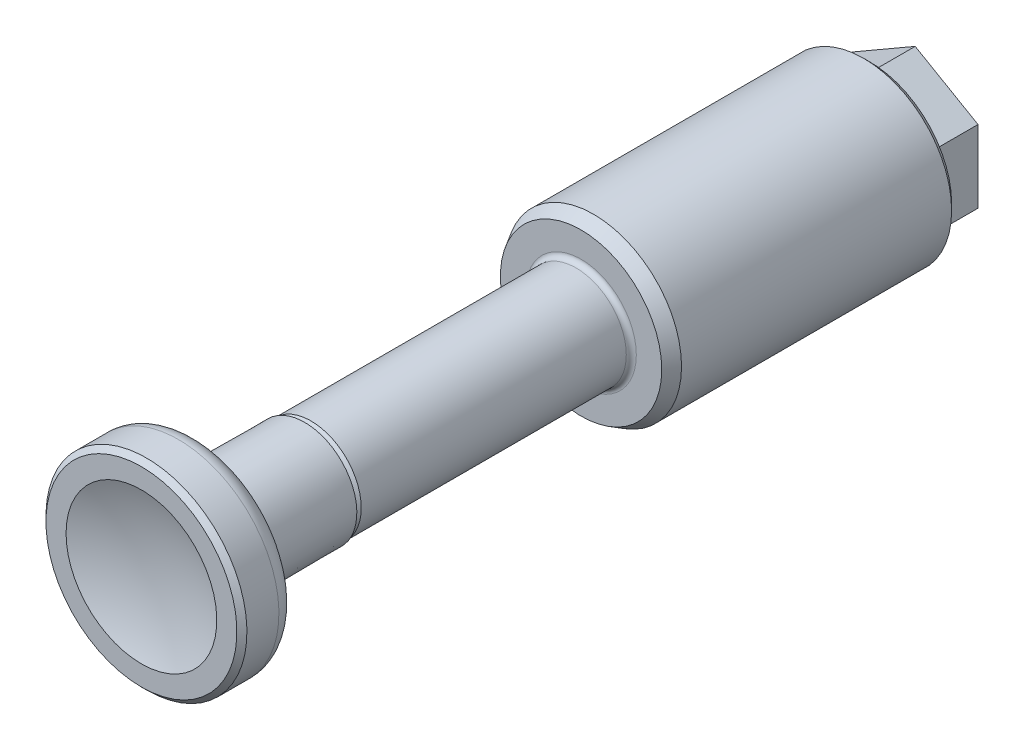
ISO-10303-21;
HEADER;
FILE_DESCRIPTION(('STEP AP214'),'2;1');
FILE_NAME('part.step','',(''),(''),'','','');
FILE_SCHEMA(('AUTOMOTIVE_DESIGN { 1 0 10303 214 1 1 1 1 }'));
ENDSEC;
DATA;
#1=APPLICATION_CONTEXT('core data for automotive mechanical design processes');
#2=APPLICATION_PROTOCOL_DEFINITION('international standard','automotive_design',2000,#1);
#3=PRODUCT_CONTEXT('',#1,'mechanical');
#4=PRODUCT('Part','Part','',(#3));
#5=PRODUCT_RELATED_PRODUCT_CATEGORY('part','',(#4));
#6=PRODUCT_DEFINITION_FORMATION('','',#4);
#7=PRODUCT_DEFINITION_CONTEXT('part definition',#1,'design');
#8=PRODUCT_DEFINITION('design','',#6,#7);
#9=PRODUCT_DEFINITION_SHAPE('','',#8);
#10=(LENGTH_UNIT() NAMED_UNIT(*) SI_UNIT(.MILLI.,.METRE.));
#11=(NAMED_UNIT(*) PLANE_ANGLE_UNIT() SI_UNIT($,.RADIAN.));
#12=(NAMED_UNIT(*) SI_UNIT($,.STERADIAN.) SOLID_ANGLE_UNIT());
#13=UNCERTAINTY_MEASURE_WITH_UNIT(LENGTH_MEASURE(1.E-05),#10,'distance_accuracy_value','');
#14=(GEOMETRIC_REPRESENTATION_CONTEXT(3) GLOBAL_UNCERTAINTY_ASSIGNED_CONTEXT((#13)) GLOBAL_UNIT_ASSIGNED_CONTEXT((#10,
#11,#12)) REPRESENTATION_CONTEXT('',''));
#15=CARTESIAN_POINT('',(0.,0.,0.));
#16=DIRECTION('',(0.,0.,1.));
#17=DIRECTION('',(1.,0.,0.));
#18=AXIS2_PLACEMENT_3D('',#15,#16,#17);
#19=CARTESIAN_POINT('',(0.,0.,48.1));
#20=DIRECTION('',(0.,0.,-1.));
#21=DIRECTION('',(1.,0.,0.));
#22=AXIS2_PLACEMENT_3D('',#19,#20,#21);
#23=CONICAL_SURFACE('',#22,4.,0.785398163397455);
#24=CARTESIAN_POINT('',(0.,0.,48.6));
#25=DIRECTION('',(0.,0.,-1.));
#26=DIRECTION('',(-1.,0.,0.));
#27=AXIS2_PLACEMENT_3D('',#24,#25,#26);
#28=CIRCLE('',#27,3.5);
#29=CARTESIAN_POINT('',(-3.50000000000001,0.,48.5999999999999));
#30=VERTEX_POINT('',#29);
#31=EDGE_CURVE('E138',#30,#30,#28,.T.);
#32=ORIENTED_EDGE('',*,*,#31,.T.);
#33=EDGE_LOOP('',(#32));
#34=FACE_BOUND('',#33,.T.);
#35=CARTESIAN_POINT('',(0.,0.,48.1));
#36=DIRECTION('',(0.,0.,-1.));
#37=DIRECTION('',(1.,0.,0.));
#38=AXIS2_PLACEMENT_3D('',#35,#36,#37);
#39=CIRCLE('',#38,4.);
#40=CARTESIAN_POINT('',(4.,0.,48.1));
#41=VERTEX_POINT('',#40);
#42=EDGE_CURVE('E158',#41,#41,#39,.T.);
#43=ORIENTED_EDGE('',*,*,#42,.F.);
#44=EDGE_LOOP('',(#43));
#45=FACE_BOUND('',#44,.T.);
#46=ADVANCED_FACE('F15',(#34,#45),#23,.T.);
#47=CARTESIAN_POINT('',(0.,0.,26.6));
#48=DIRECTION('',(0.,0.,-1.));
#49=DIRECTION('',(1.,0.,0.));
#50=AXIS2_PLACEMENT_3D('',#47,#48,#49);
#51=CYLINDRICAL_SURFACE('',#50,4.);
#52=CARTESIAN_POINT('',(0.,0.,27.));
#53=DIRECTION('',(0.,0.,-1.));
#54=DIRECTION('',(1.,0.,0.));
#55=AXIS2_PLACEMENT_3D('',#52,#53,#54);
#56=CIRCLE('',#55,4.);
#57=CARTESIAN_POINT('',(4.,0.,27.));
#58=VERTEX_POINT('',#57);
#59=EDGE_CURVE('E161',#58,#58,#56,.F.);
#60=ORIENTED_EDGE('',*,*,#59,.T.);
#61=EDGE_LOOP('',(#60));
#62=FACE_BOUND('',#61,.T.);
#63=ORIENTED_EDGE('',*,*,#42,.T.);
#64=EDGE_LOOP('',(#63));
#65=FACE_BOUND('',#64,.T.);
#66=ADVANCED_FACE('F329',(#62,#65),#51,.T.);
#67=CARTESIAN_POINT('',(0.,0.,27.));
#68=DIRECTION('',(0.,0.,-1.));
#69=DIRECTION('',(1.,0.,0.));
#70=AXIS2_PLACEMENT_3D('',#67,#68,#69);
#71=TOROIDAL_SURFACE('',#70,4.4,0.4);
#72=CARTESIAN_POINT('',(0.,0.,26.6));
#73=DIRECTION('',(0.,0.,-1.));
#74=DIRECTION('',(1.,0.,0.));
#75=AXIS2_PLACEMENT_3D('',#72,#73,#74);
#76=CIRCLE('',#75,4.4);
#77=CARTESIAN_POINT('',(4.4,0.,26.6));
#78=VERTEX_POINT('',#77);
#79=EDGE_CURVE('E105',#78,#78,#76,.T.);
#80=ORIENTED_EDGE('',*,*,#79,.F.);
#81=EDGE_LOOP('',(#80));
#82=FACE_BOUND('',#81,.T.);
#83=ORIENTED_EDGE('',*,*,#59,.F.);
#84=EDGE_LOOP('',(#83));
#85=FACE_BOUND('',#84,.T.);
#86=ADVANCED_FACE('F17',(#82,#85),#71,.F.);
#87=CARTESIAN_POINT('',(0.,0.,26.6));
#88=DIRECTION('',(0.,0.,-1.));
#89=DIRECTION('',(1.,0.,0.));
#90=AXIS2_PLACEMENT_3D('',#87,#88,#89);
#91=PLANE('',#90);
#92=ORIENTED_EDGE('',*,*,#79,.T.);
#93=EDGE_LOOP('',(#92));
#94=FACE_BOUND('',#93,.T.);
#95=CARTESIAN_POINT('',(0.,0.,26.6));
#96=DIRECTION('',(0.,0.,-1.));
#97=DIRECTION('',(1.,0.,0.));
#98=AXIS2_PLACEMENT_3D('',#95,#96,#97);
#99=CIRCLE('',#98,6.42264973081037);
#100=CARTESIAN_POINT('',(6.42264973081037,0.,26.6));
#101=VERTEX_POINT('',#100);
#102=EDGE_CURVE('E146',#101,#101,#99,.F.);
#103=ORIENTED_EDGE('',*,*,#102,.T.);
#104=EDGE_LOOP('',(#103));
#105=FACE_BOUND('',#104,.T.);
#106=ADVANCED_FACE('F321',(#94,#105),#91,.F.);
#107=CARTESIAN_POINT('',(0.,0.,25.6));
#108=DIRECTION('',(0.,0.,-1.));
#109=DIRECTION('',(1.,0.,0.));
#110=AXIS2_PLACEMENT_3D('',#107,#108,#109);
#111=CONICAL_SURFACE('',#110,7.,0.523598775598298);
#112=ORIENTED_EDGE('',*,*,#102,.F.);
#113=EDGE_LOOP('',(#112));
#114=FACE_BOUND('',#113,.T.);
#115=CARTESIAN_POINT('',(0.,0.,25.6));
#116=DIRECTION('',(0.,0.,-1.));
#117=DIRECTION('',(1.,0.,0.));
#118=AXIS2_PLACEMENT_3D('',#115,#116,#117);
#119=CIRCLE('',#118,7.);
#120=CARTESIAN_POINT('',(7.,0.,25.6));
#121=VERTEX_POINT('',#120);
#122=EDGE_CURVE('E142',#121,#121,#119,.T.);
#123=ORIENTED_EDGE('',*,*,#122,.F.);
#124=EDGE_LOOP('',(#123));
#125=FACE_BOUND('',#124,.T.);
#126=ADVANCED_FACE('F330',(#114,#125),#111,.T.);
#127=CARTESIAN_POINT('',(0.,0.,3.6));
#128=DIRECTION('',(0.,0.,1.));
#129=DIRECTION('',(-1.,0.,0.));
#130=AXIS2_PLACEMENT_3D('',#127,#128,#129);
#131=CYLINDRICAL_SURFACE('',#130,7.);
#132=CARTESIAN_POINT('',(0.,0.,4.1));
#133=DIRECTION('',(0.,0.,-1.));
#134=DIRECTION('',(1.,0.,0.));
#135=AXIS2_PLACEMENT_3D('',#132,#133,#134);
#136=CIRCLE('',#135,7.);
#137=CARTESIAN_POINT('',(7.,0.,4.1));
#138=VERTEX_POINT('',#137);
#139=EDGE_CURVE('E152',#138,#138,#136,.F.);
#140=ORIENTED_EDGE('',*,*,#139,.T.);
#141=EDGE_LOOP('',(#140));
#142=FACE_BOUND('',#141,.T.);
#143=ORIENTED_EDGE('',*,*,#122,.T.);
#144=EDGE_LOOP('',(#143));
#145=FACE_BOUND('',#144,.T.);
#146=ADVANCED_FACE('F326',(#142,#145),#131,.T.);
#147=CARTESIAN_POINT('',(0.,0.,3.6));
#148=DIRECTION('',(0.,0.,1.));
#149=DIRECTION('',(-1.,0.,0.));
#150=AXIS2_PLACEMENT_3D('',#147,#148,#149);
#151=CONICAL_SURFACE('',#150,6.5,0.785398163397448);
#152=ORIENTED_EDGE('',*,*,#139,.F.);
#153=EDGE_LOOP('',(#152));
#154=FACE_BOUND('',#153,.T.);
#155=CARTESIAN_POINT('',(0.,0.,3.6));
#156=DIRECTION('',(0.,0.,-1.));
#157=DIRECTION('',(1.,0.,0.));
#158=AXIS2_PLACEMENT_3D('',#155,#156,#157);
#159=CIRCLE('',#158,6.5);
#160=CARTESIAN_POINT('',(6.5,0.,3.6));
#161=VERTEX_POINT('',#160);
#162=EDGE_CURVE('E149',#161,#161,#159,.T.);
#163=ORIENTED_EDGE('',*,*,#162,.F.);
#164=EDGE_LOOP('',(#163));
#165=FACE_BOUND('',#164,.T.);
#166=ADVANCED_FACE('F317',(#154,#165),#151,.T.);
#167=CARTESIAN_POINT('',(0.,0.,3.6));
#168=DIRECTION('',(0.,0.,-1.));
#169=DIRECTION('',(1.,0.,0.));
#170=AXIS2_PLACEMENT_3D('',#167,#168,#169);
#171=PLANE('',#170);
#172=ORIENTED_EDGE('',*,*,#162,.T.);
#173=EDGE_LOOP('',(#172));
#174=FACE_BOUND('',#173,.T.);
#175=DIRECTION('',(-0.86602540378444,-0.5,0.));
#176=VECTOR('',#175,1.);
#177=CARTESIAN_POINT('',(5.,-2.88675134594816,3.6));
#178=LINE('',#177,#176);
#179=CARTESIAN_POINT('',(5.,-2.88675134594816,3.6));
#180=VERTEX_POINT('',#179);
#181=CARTESIAN_POINT('',(0.,-5.77350269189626,3.6));
#182=VERTEX_POINT('',#181);
#183=EDGE_CURVE('E98',#180,#182,#178,.T.);
#184=ORIENTED_EDGE('',*,*,#183,.F.);
#185=DIRECTION('',(0.,-1.,0.));
#186=VECTOR('',#185,1.);
#187=CARTESIAN_POINT('',(5.,2.88675134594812,3.6));
#188=LINE('',#187,#186);
#189=CARTESIAN_POINT('',(5.,2.88675134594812,3.6));
#190=VERTEX_POINT('',#189);
#191=EDGE_CURVE('E83',#190,#180,#188,.T.);
#192=ORIENTED_EDGE('',*,*,#191,.F.);
#193=DIRECTION('',(0.866025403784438,-0.5,0.));
#194=VECTOR('',#193,1.);
#195=CARTESIAN_POINT('',(0.,5.77350269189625,3.6));
#196=LINE('',#195,#194);
#197=CARTESIAN_POINT('',(0.,5.77350269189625,3.6));
#198=VERTEX_POINT('',#197);
#199=EDGE_CURVE('E95',#198,#190,#196,.T.);
#200=ORIENTED_EDGE('',*,*,#199,.F.);
#201=DIRECTION('',(0.866025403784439,0.5,0.));
#202=VECTOR('',#201,1.);
#203=CARTESIAN_POINT('',(-5.,2.88675134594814,3.6));
#204=LINE('',#203,#202);
#205=CARTESIAN_POINT('',(-5.,2.88675134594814,3.6));
#206=VERTEX_POINT('',#205);
#207=EDGE_CURVE('E274',#206,#198,#204,.T.);
#208=ORIENTED_EDGE('',*,*,#207,.F.);
#209=DIRECTION('',(0.,1.,0.));
#210=VECTOR('',#209,1.);
#211=CARTESIAN_POINT('',(-5.,-2.88675134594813,3.6));
#212=LINE('',#211,#210);
#213=CARTESIAN_POINT('',(-5.,-2.88675134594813,3.6));
#214=VERTEX_POINT('',#213);
#215=EDGE_CURVE('E272',#214,#206,#212,.T.);
#216=ORIENTED_EDGE('',*,*,#215,.F.);
#217=DIRECTION('',(-0.866025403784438,0.5,0.));
#218=VECTOR('',#217,1.);
#219=CARTESIAN_POINT('',(0.,-5.77350269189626,3.6));
#220=LINE('',#219,#218);
#221=EDGE_CURVE('E101',#182,#214,#220,.T.);
#222=ORIENTED_EDGE('',*,*,#221,.F.);
#223=EDGE_LOOP('',(#184,#192,#200,#208,#216,#222));
#224=FACE_BOUND('',#223,.T.);
#225=ADVANCED_FACE('F99',(#174,#224),#171,.T.);
#226=CARTESIAN_POINT('',(5.,-2.88675134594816,0.));
#227=DIRECTION('',(-0.5,0.86602540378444,0.));
#228=DIRECTION('',(0.86602540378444,0.5,0.));
#229=AXIS2_PLACEMENT_3D('',#226,#227,#228);
#230=PLANE('',#229);
#231=ORIENTED_EDGE('',*,*,#183,.T.);
#232=DIRECTION('',(0.,0.,1.));
#233=VECTOR('',#232,1.);
#234=CARTESIAN_POINT('',(0.,-5.77350269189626,0.));
#235=LINE('',#234,#233);
#236=CARTESIAN_POINT('',(0.,-5.77350269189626,0.));
#237=VERTEX_POINT('',#236);
#238=EDGE_CURVE('E125',#237,#182,#235,.T.);
#239=ORIENTED_EDGE('',*,*,#238,.F.);
#240=DIRECTION('',(-0.86602540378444,-0.5,0.));
#241=VECTOR('',#240,1.);
#242=CARTESIAN_POINT('',(5.,-2.88675134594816,0.));
#243=LINE('',#242,#241);
#244=CARTESIAN_POINT('',(5.,-2.88675134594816,0.));
#245=VERTEX_POINT('',#244);
#246=EDGE_CURVE('E94',#245,#237,#243,.T.);
#247=ORIENTED_EDGE('',*,*,#246,.F.);
#248=DIRECTION('',(0.,0.,1.));
#249=VECTOR('',#248,1.);
#250=CARTESIAN_POINT('',(5.,-2.88675134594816,0.));
#251=LINE('',#250,#249);
#252=EDGE_CURVE('E88',#245,#180,#251,.T.);
#253=ORIENTED_EDGE('',*,*,#252,.T.);
#254=EDGE_LOOP('',(#231,#239,#247,#253));
#255=FACE_BOUND('',#254,.T.);
#256=ADVANCED_FACE('F107',(#255),#230,.F.);
#257=CARTESIAN_POINT('',(5.,2.88675134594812,0.));
#258=DIRECTION('',(-1.,0.,0.));
#259=DIRECTION('',(0.,1.,0.));
#260=AXIS2_PLACEMENT_3D('',#257,#258,#259);
#261=PLANE('',#260);
#262=ORIENTED_EDGE('',*,*,#191,.T.);
#263=ORIENTED_EDGE('',*,*,#252,.F.);
#264=DIRECTION('',(0.,-1.,0.));
#265=VECTOR('',#264,1.);
#266=CARTESIAN_POINT('',(5.,2.88675134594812,0.));
#267=LINE('',#266,#265);
#268=CARTESIAN_POINT('',(5.,2.88675134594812,0.));
#269=VERTEX_POINT('',#268);
#270=EDGE_CURVE('E109',#269,#245,#267,.T.);
#271=ORIENTED_EDGE('',*,*,#270,.F.);
#272=DIRECTION('',(0.,0.,1.));
#273=VECTOR('',#272,1.);
#274=CARTESIAN_POINT('',(5.,2.88675134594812,0.));
#275=LINE('',#274,#273);
#276=EDGE_CURVE('E91',#269,#190,#275,.T.);
#277=ORIENTED_EDGE('',*,*,#276,.T.);
#278=EDGE_LOOP('',(#262,#263,#271,#277));
#279=FACE_BOUND('',#278,.T.);
#280=ADVANCED_FACE('F85',(#279),#261,.F.);
#281=CARTESIAN_POINT('',(0.,5.77350269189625,0.));
#282=DIRECTION('',(-0.5,-0.866025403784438,0.));
#283=DIRECTION('',(-0.866025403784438,0.5,0.));
#284=AXIS2_PLACEMENT_3D('',#281,#282,#283);
#285=PLANE('',#284);
#286=ORIENTED_EDGE('',*,*,#199,.T.);
#287=ORIENTED_EDGE('',*,*,#276,.F.);
#288=DIRECTION('',(0.866025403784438,-0.5,0.));
#289=VECTOR('',#288,1.);
#290=CARTESIAN_POINT('',(0.,5.77350269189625,0.));
#291=LINE('',#290,#289);
#292=CARTESIAN_POINT('',(0.,5.77350269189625,0.));
#293=VERTEX_POINT('',#292);
#294=EDGE_CURVE('E113',#293,#269,#291,.T.);
#295=ORIENTED_EDGE('',*,*,#294,.F.);
#296=DIRECTION('',(0.,0.,1.));
#297=VECTOR('',#296,1.);
#298=CARTESIAN_POINT('',(0.,5.77350269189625,0.));
#299=LINE('',#298,#297);
#300=EDGE_CURVE('E111',#293,#198,#299,.T.);
#301=ORIENTED_EDGE('',*,*,#300,.T.);
#302=EDGE_LOOP('',(#286,#287,#295,#301));
#303=FACE_BOUND('',#302,.T.);
#304=ADVANCED_FACE('F276',(#303),#285,.F.);
#305=CARTESIAN_POINT('',(-5.,2.88675134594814,0.));
#306=DIRECTION('',(0.5,-0.866025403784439,0.));
#307=DIRECTION('',(-0.866025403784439,-0.5,0.));
#308=AXIS2_PLACEMENT_3D('',#305,#306,#307);
#309=PLANE('',#308);
#310=ORIENTED_EDGE('',*,*,#207,.T.);
#311=ORIENTED_EDGE('',*,*,#300,.F.);
#312=DIRECTION('',(0.866025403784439,0.5,0.));
#313=VECTOR('',#312,1.);
#314=CARTESIAN_POINT('',(-5.,2.88675134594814,0.));
#315=LINE('',#314,#313);
#316=CARTESIAN_POINT('',(-5.,2.88675134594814,0.));
#317=VERTEX_POINT('',#316);
#318=EDGE_CURVE('E268',#317,#293,#315,.T.);
#319=ORIENTED_EDGE('',*,*,#318,.F.);
#320=DIRECTION('',(0.,0.,1.));
#321=VECTOR('',#320,1.);
#322=CARTESIAN_POINT('',(-5.,2.88675134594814,0.));
#323=LINE('',#322,#321);
#324=EDGE_CURVE('E119',#317,#206,#323,.T.);
#325=ORIENTED_EDGE('',*,*,#324,.T.);
#326=EDGE_LOOP('',(#310,#311,#319,#325));
#327=FACE_BOUND('',#326,.T.);
#328=ADVANCED_FACE('F283',(#327),#309,.F.);
#329=CARTESIAN_POINT('',(-5.,-2.88675134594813,0.));
#330=DIRECTION('',(1.,0.,0.));
#331=DIRECTION('',(0.,-1.,0.));
#332=AXIS2_PLACEMENT_3D('',#329,#330,#331);
#333=PLANE('',#332);
#334=ORIENTED_EDGE('',*,*,#215,.T.);
#335=ORIENTED_EDGE('',*,*,#324,.F.);
#336=DIRECTION('',(0.,1.,0.));
#337=VECTOR('',#336,1.);
#338=CARTESIAN_POINT('',(-5.,-2.88675134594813,0.));
#339=LINE('',#338,#337);
#340=CARTESIAN_POINT('',(-5.,-2.88675134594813,0.));
#341=VERTEX_POINT('',#340);
#342=EDGE_CURVE('E266',#341,#317,#339,.T.);
#343=ORIENTED_EDGE('',*,*,#342,.F.);
#344=DIRECTION('',(0.,0.,1.));
#345=VECTOR('',#344,1.);
#346=CARTESIAN_POINT('',(-5.,-2.88675134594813,0.));
#347=LINE('',#346,#345);
#348=EDGE_CURVE('E122',#341,#214,#347,.T.);
#349=ORIENTED_EDGE('',*,*,#348,.T.);
#350=EDGE_LOOP('',(#334,#335,#343,#349));
#351=FACE_BOUND('',#350,.T.);
#352=ADVANCED_FACE('F286',(#351),#333,.F.);
#353=CARTESIAN_POINT('',(0.,-5.77350269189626,0.));
#354=DIRECTION('',(0.5,0.866025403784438,0.));
#355=DIRECTION('',(0.866025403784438,-0.5,0.));
#356=AXIS2_PLACEMENT_3D('',#353,#354,#355);
#357=PLANE('',#356);
#358=ORIENTED_EDGE('',*,*,#221,.T.);
#359=ORIENTED_EDGE('',*,*,#348,.F.);
#360=DIRECTION('',(-0.866025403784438,0.5,0.));
#361=VECTOR('',#360,1.);
#362=CARTESIAN_POINT('',(0.,-5.77350269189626,0.));
#363=LINE('',#362,#361);
#364=EDGE_CURVE('E264',#237,#341,#363,.T.);
#365=ORIENTED_EDGE('',*,*,#364,.F.);
#366=ORIENTED_EDGE('',*,*,#238,.T.);
#367=EDGE_LOOP('',(#358,#359,#365,#366));
#368=FACE_BOUND('',#367,.T.);
#369=ADVANCED_FACE('F289',(#368),#357,.F.);
#370=CARTESIAN_POINT('',(0.,-5.77350269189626,0.));
#371=DIRECTION('',(0.,0.,-1.));
#372=DIRECTION('',(0.,1.,0.));
#373=AXIS2_PLACEMENT_3D('',#370,#371,#372);
#374=PLANE('',#373);
#375=CARTESIAN_POINT('',(0.,0.,0.));
#376=DIRECTION('',(0.,0.,-1.));
#377=DIRECTION('',(0.,1.,0.));
#378=AXIS2_PLACEMENT_3D('',#375,#376,#377);
#379=CIRCLE('',#378,3.5);
#380=CARTESIAN_POINT('',(0.,3.5,0.));
#381=VERTEX_POINT('',#380);
#382=EDGE_CURVE('E130',#381,#381,#379,.F.);
#383=ORIENTED_EDGE('',*,*,#382,.T.);
#384=EDGE_LOOP('',(#383));
#385=FACE_BOUND('',#384,.T.);
#386=ORIENTED_EDGE('',*,*,#246,.T.);
#387=ORIENTED_EDGE('',*,*,#364,.T.);
#388=ORIENTED_EDGE('',*,*,#342,.T.);
#389=ORIENTED_EDGE('',*,*,#318,.T.);
#390=ORIENTED_EDGE('',*,*,#294,.T.);
#391=ORIENTED_EDGE('',*,*,#270,.T.);
#392=EDGE_LOOP('',(#386,#387,#388,#389,#390,#391));
#393=FACE_BOUND('',#392,.T.);
#394=ADVANCED_FACE('F291',(#385,#393),#374,.T.);
#395=CARTESIAN_POINT('',(0.,0.,1.));
#396=DIRECTION('',(0.,0.,-1.));
#397=DIRECTION('',(0.,1.,0.));
#398=AXIS2_PLACEMENT_3D('',#395,#396,#397);
#399=CONICAL_SURFACE('',#398,2.5,0.785398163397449);
#400=CARTESIAN_POINT('',(0.,0.,0.5));
#401=DIRECTION('',(0.,0.,-1.));
#402=DIRECTION('',(0.,1.,0.));
#403=AXIS2_PLACEMENT_3D('',#400,#401,#402);
#404=CIRCLE('',#403,3.);
#405=CARTESIAN_POINT('',(0.,3.,0.5));
#406=VERTEX_POINT('',#405);
#407=EDGE_CURVE('E143',#406,#406,#404,.T.);
#408=ORIENTED_EDGE('',*,*,#407,.F.);
#409=EDGE_LOOP('',(#408));
#410=FACE_BOUND('',#409,.T.);
#411=ORIENTED_EDGE('',*,*,#382,.F.);
#412=EDGE_LOOP('',(#411));
#413=FACE_BOUND('',#412,.T.);
#414=ADVANCED_FACE('F293',(#410,#413),#399,.F.);
#415=CARTESIAN_POINT('',(0.,0.,48.6));
#416=DIRECTION('',(0.,0.,-1.));
#417=DIRECTION('',(0.,-1.00000000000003,0.));
#418=AXIS2_PLACEMENT_3D('',#415,#416,#417);
#419=PLANE('',#418);
#420=ORIENTED_EDGE('',*,*,#31,.F.);
#421=EDGE_LOOP('',(#420));
#422=FACE_BOUND('',#421,.T.);
#423=CARTESIAN_POINT('',(0.,0.,48.6));
#424=DIRECTION('',(0.,0.,-1.));
#425=DIRECTION('',(0.,-1.00000000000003,0.));
#426=AXIS2_PLACEMENT_3D('',#423,#424,#425);
#427=CIRCLE('',#426,4.15);
#428=CARTESIAN_POINT('',(0.,-4.15000000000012,48.6));
#429=VERTEX_POINT('',#428);
#430=EDGE_CURVE('E258',#429,#429,#427,.T.);
#431=ORIENTED_EDGE('',*,*,#430,.T.);
#432=EDGE_LOOP('',(#431));
#433=FACE_BOUND('',#432,.T.);
#434=ADVANCED_FACE('F303',(#422,#433),#419,.T.);
#435=CARTESIAN_POINT('',(0.,0.,48.6));
#436=DIRECTION('',(0.,0.,1.));
#437=DIRECTION('',(0.,1.00000000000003,0.));
#438=AXIS2_PLACEMENT_3D('',#435,#436,#437);
#439=CONICAL_SURFACE('',#438,4.15,0.0087266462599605);
#440=CARTESIAN_POINT('',(0.,0.,55.9184746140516));
#441=DIRECTION('',(0.,0.,-1.));
#442=DIRECTION('',(0.,-1.00000000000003,0.));
#443=AXIS2_PLACEMENT_3D('',#440,#441,#442);
#444=CIRCLE('',#443,4.21386736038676);
#445=CARTESIAN_POINT('',(0.,-4.21386736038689,55.9184746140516));
#446=VERTEX_POINT('',#445);
#447=EDGE_CURVE('E255',#446,#446,#444,.T.);
#448=ORIENTED_EDGE('',*,*,#447,.T.);
#449=EDGE_LOOP('',(#448));
#450=FACE_BOUND('',#449,.T.);
#451=ORIENTED_EDGE('',*,*,#430,.F.);
#452=EDGE_LOOP('',(#451));
#453=FACE_BOUND('',#452,.T.);
#454=ADVANCED_FACE('F372',(#450,#453),#439,.T.);
#455=CARTESIAN_POINT('',(0.,0.,55.9119297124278));
#456=DIRECTION('',(0.,0.,-1.));
#457=DIRECTION('',(0.,-1.00000000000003,0.));
#458=AXIS2_PLACEMENT_3D('',#455,#456,#457);
#459=TOROIDAL_SURFACE('',#458,4.96383880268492,0.750000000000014);
#460=CARTESIAN_POINT('',(0.,0.,56.6363740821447));
#461=DIRECTION('',(0.,0.,-1.));
#462=DIRECTION('',(0.,-1.00000000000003,0.));
#463=AXIS2_PLACEMENT_3D('',#460,#461,#462);
#464=CIRCLE('',#463,4.76972451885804);
#465=CARTESIAN_POINT('',(0.,-4.76972451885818,56.6363740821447));
#466=VERTEX_POINT('',#465);
#467=EDGE_CURVE('E252',#466,#466,#464,.T.);
#468=ORIENTED_EDGE('',*,*,#467,.T.);
#469=EDGE_LOOP('',(#468));
#470=FACE_BOUND('',#469,.T.);
#471=ORIENTED_EDGE('',*,*,#447,.F.);
#472=EDGE_LOOP('',(#471));
#473=FACE_BOUND('',#472,.T.);
#474=ADVANCED_FACE('F377',(#470,#473),#459,.F.);
#475=CARTESIAN_POINT('',(0.,0.,56.6363740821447));
#476=DIRECTION('',(0.,0.,1.));
#477=DIRECTION('',(0.,1.00000000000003,0.));
#478=AXIS2_PLACEMENT_3D('',#475,#476,#477);
#479=CONICAL_SURFACE('',#478,4.76972451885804,1.30899693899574);
#480=CARTESIAN_POINT('',(0.,0.,57.2040255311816));
#481=DIRECTION('',(0.,0.,-1.));
#482=DIRECTION('',(0.,-1.00000000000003,0.));
#483=AXIS2_PLACEMENT_3D('',#480,#481,#482);
#484=CIRCLE('',#483,6.88822856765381);
#485=CARTESIAN_POINT('',(-1.21980445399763E-13,-6.88822856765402,57.2040255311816));
#486=VERTEX_POINT('',#485);
#487=EDGE_CURVE('E249',#486,#486,#484,.T.);
#488=ORIENTED_EDGE('',*,*,#487,.T.);
#489=EDGE_LOOP('',(#488));
#490=FACE_BOUND('',#489,.T.);
#491=ORIENTED_EDGE('',*,*,#467,.F.);
#492=EDGE_LOOP('',(#491));
#493=FACE_BOUND('',#492,.T.);
#494=ADVANCED_FACE('F384',(#490,#493),#479,.T.);
#495=CARTESIAN_POINT('',(0.,0.,58.6529142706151));
#496=DIRECTION('',(0.,0.,-1.));
#497=DIRECTION('',(0.,-1.00000000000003,0.));
#498=AXIS2_PLACEMENT_3D('',#495,#496,#497);
#499=TOROIDAL_SURFACE('',#498,6.5,1.49999999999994);
#500=CARTESIAN_POINT('',(0.,0.,58.6529142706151));
#501=DIRECTION('',(0.,0.,-1.));
#502=DIRECTION('',(0.,-1.00000000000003,0.));
#503=AXIS2_PLACEMENT_3D('',#500,#501,#502);
#504=CIRCLE('',#503,8.);
#505=CARTESIAN_POINT('',(-1.5625955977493E-13,-8.00000000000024,58.6529142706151));
#506=VERTEX_POINT('',#505);
#507=EDGE_CURVE('E246',#506,#506,#504,.T.);
#508=ORIENTED_EDGE('',*,*,#507,.T.);
#509=EDGE_LOOP('',(#508));
#510=FACE_BOUND('',#509,.T.);
#511=ORIENTED_EDGE('',*,*,#487,.F.);
#512=EDGE_LOOP('',(#511));
#513=FACE_BOUND('',#512,.T.);
#514=ADVANCED_FACE('F390',(#510,#513),#499,.T.);
#515=CARTESIAN_POINT('',(0.,0.,48.6));
#516=DIRECTION('',(0.,0.,-1.));
#517=DIRECTION('',(0.,-1.00000000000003,0.));
#518=AXIS2_PLACEMENT_3D('',#515,#516,#517);
#519=CYLINDRICAL_SURFACE('',#518,8.);
#520=CARTESIAN_POINT('',(-1.08767152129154E-13,1.196959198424E-13,61.2));
#521=DIRECTION('',(0.,0.,-1.));
#522=DIRECTION('',(0.,-1.00000000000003,0.));
#523=AXIS2_PLACEMENT_3D('',#520,#521,#522);
#524=CIRCLE('',#523,8.);
#525=CARTESIAN_POINT('',(-1.95364548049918E-13,-8.00000000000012,61.2));
#526=VERTEX_POINT('',#525);
#527=EDGE_CURVE('E243',#526,#526,#524,.T.);
#528=ORIENTED_EDGE('',*,*,#527,.T.);
#529=EDGE_LOOP('',(#528));
#530=FACE_BOUND('',#529,.T.);
#531=ORIENTED_EDGE('',*,*,#507,.F.);
#532=EDGE_LOOP('',(#531));
#533=FACE_BOUND('',#532,.T.);
#534=ADVANCED_FACE('F394',(#530,#533),#519,.T.);
#535=CARTESIAN_POINT('',(-1.08767152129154E-13,1.196959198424E-13,61.2));
#536=DIRECTION('',(0.,0.,-1.));
#537=DIRECTION('',(0.,-1.00000000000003,0.));
#538=AXIS2_PLACEMENT_3D('',#535,#536,#537);
#539=CONICAL_SURFACE('',#538,8.,0.785398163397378);
#540=CARTESIAN_POINT('',(-1.1490828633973E-13,1.196959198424E-13,61.6));
#541=DIRECTION('',(0.,0.,-1.));
#542=DIRECTION('',(0.,-1.00000000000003,0.));
#543=AXIS2_PLACEMENT_3D('',#540,#541,#542);
#544=CIRCLE('',#543,7.6);
#545=CARTESIAN_POINT('',(-1.97175812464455E-13,-7.60000000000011,61.6));
#546=VERTEX_POINT('',#545);
#547=EDGE_CURVE('E240',#546,#546,#544,.T.);
#548=ORIENTED_EDGE('',*,*,#547,.T.);
#549=EDGE_LOOP('',(#548));
#550=FACE_BOUND('',#549,.T.);
#551=ORIENTED_EDGE('',*,*,#527,.F.);
#552=EDGE_LOOP('',(#551));
#553=FACE_BOUND('',#552,.T.);
#554=ADVANCED_FACE('F398',(#550,#553),#539,.T.);
#555=CARTESIAN_POINT('',(-6.00000000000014,0.,61.6));
#556=DIRECTION('',(0.,0.,1.));
#557=DIRECTION('',(0.,1.00000000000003,0.));
#558=AXIS2_PLACEMENT_3D('',#555,#556,#557);
#559=PLANE('',#558);
#560=CARTESIAN_POINT('',(-1.1490828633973E-13,1.196959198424E-13,61.6));
#561=DIRECTION('',(0.,0.,-1.));
#562=DIRECTION('',(0.,-1.00000000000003,0.));
#563=AXIS2_PLACEMENT_3D('',#560,#561,#562);
#564=CIRCLE('',#563,6.);
#565=CARTESIAN_POINT('',(-1.79856333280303E-13,-6.00000000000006,61.6));
#566=VERTEX_POINT('',#565);
#567=EDGE_CURVE('E133',#566,#566,#564,.T.);
#568=ORIENTED_EDGE('',*,*,#567,.T.);
#569=EDGE_LOOP('',(#568));
#570=FACE_BOUND('',#569,.T.);
#571=ORIENTED_EDGE('',*,*,#547,.F.);
#572=EDGE_LOOP('',(#571));
#573=FACE_BOUND('',#572,.T.);
#574=ADVANCED_FACE('F311',(#570,#573),#559,.T.);
#575=CARTESIAN_POINT('',(-3.42124347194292E-13,0.,76.3996153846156));
#576=DIRECTION('',(0.,0.,-1.));
#577=DIRECTION('',(-1.,0.,0.));
#578=AXIS2_PLACEMENT_3D('',#575,#576,#577);
#579=SPHERICAL_SURFACE('',#578,15.9696153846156);
#580=ORIENTED_EDGE('',*,*,#567,.F.);
#581=EDGE_LOOP('',(#580));
#582=FACE_BOUND('',#581,.T.);
#583=ADVANCED_FACE('F296',(#582),#579,.F.);
#584=CARTESIAN_POINT('',(0.,0.,12.0852813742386));
#585=DIRECTION('',(0.,0.,-1.));
#586=DIRECTION('',(0.,1.,0.));
#587=AXIS2_PLACEMENT_3D('',#584,#585,#586);
#588=CYLINDRICAL_SURFACE('',#587,3.);
#589=ORIENTED_EDGE('',*,*,#407,.T.);
#590=EDGE_LOOP('',(#589));
#591=FACE_BOUND('',#590,.T.);
#592=CARTESIAN_POINT('',(0.,0.,3.1));
#593=DIRECTION('',(0.,0.,1.));
#594=DIRECTION('',(0.,-1.,0.));
#595=AXIS2_PLACEMENT_3D('',#592,#593,#594);
#596=CIRCLE('',#595,3.);
#597=CARTESIAN_POINT('',(0.,-3.,3.1));
#598=VERTEX_POINT('',#597);
#599=EDGE_CURVE('E165',#598,#598,#596,.T.);
#600=ORIENTED_EDGE('',*,*,#599,.T.);
#601=EDGE_LOOP('',(#600));
#602=FACE_BOUND('',#601,.T.);
#603=ADVANCED_FACE('F310',(#591,#602),#588,.F.);
#604=CARTESIAN_POINT('',(0.,0.,5.1));
#605=DIRECTION('',(0.,0.,-1.));
#606=DIRECTION('',(1.,0.,0.));
#607=AXIS2_PLACEMENT_3D('',#604,#605,#606);
#608=CONICAL_SURFACE('',#607,2.55,0.523598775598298);
#609=CARTESIAN_POINT('',(0.,0.,4.32057713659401));
#610=DIRECTION('',(0.,0.,-1.));
#611=DIRECTION('',(0.,1.,0.));
#612=AXIS2_PLACEMENT_3D('',#609,#610,#611);
#613=CIRCLE('',#612,3.);
#614=CARTESIAN_POINT('',(0.,3.,4.32057713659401));
#615=VERTEX_POINT('',#614);
#616=EDGE_CURVE('E19',#615,#615,#613,.T.);
#617=ORIENTED_EDGE('',*,*,#616,.F.);
#618=EDGE_LOOP('',(#617));
#619=FACE_BOUND('',#618,.T.);
#620=CARTESIAN_POINT('',(0.,0.,3.6));
#621=DIRECTION('',(0.,0.,-1.));
#622=DIRECTION('',(1.,0.,0.));
#623=AXIS2_PLACEMENT_3D('',#620,#621,#622);
#624=CIRCLE('',#623,3.41602540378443);
#625=CARTESIAN_POINT('',(3.41602540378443,0.,3.6));
#626=VERTEX_POINT('',#625);
#627=EDGE_CURVE('E155',#626,#626,#624,.F.);
#628=ORIENTED_EDGE('',*,*,#627,.F.);
#629=EDGE_LOOP('',(#628));
#630=FACE_BOUND('',#629,.T.);
#631=ADVANCED_FACE('F335',(#619,#630),#608,.F.);
#632=CARTESIAN_POINT('',(0.,0.,3.6));
#633=DIRECTION('',(0.,0.,-1.));
#634=DIRECTION('',(0.,1.,0.));
#635=AXIS2_PLACEMENT_3D('',#632,#633,#634);
#636=CIRCLE('',#635,3.5);
#637=CARTESIAN_POINT('',(0.,3.5,3.6));
#638=VERTEX_POINT('',#637);
#639=EDGE_CURVE('E127',#638,#638,#636,.T.);
#640=ORIENTED_EDGE('',*,*,#639,.T.);
#641=EDGE_LOOP('',(#640));
#642=FACE_BOUND('',#641,.T.);
#643=ORIENTED_EDGE('',*,*,#627,.T.);
#644=EDGE_LOOP('',(#643));
#645=FACE_BOUND('',#644,.T.);
#646=ADVANCED_FACE('F320',(#642,#645),#171,.T.);
#647=CARTESIAN_POINT('',(0.,0.,3.6));
#648=DIRECTION('',(0.,0.,1.));
#649=DIRECTION('',(0.,-1.,0.));
#650=AXIS2_PLACEMENT_3D('',#647,#648,#649);
#651=CONICAL_SURFACE('',#650,3.5,0.785398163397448);
#652=ORIENTED_EDGE('',*,*,#599,.F.);
#653=EDGE_LOOP('',(#652));
#654=FACE_BOUND('',#653,.T.);
#655=ORIENTED_EDGE('',*,*,#639,.F.);
#656=EDGE_LOOP('',(#655));
#657=FACE_BOUND('',#656,.T.);
#658=ADVANCED_FACE('F334',(#654,#657),#651,.F.);
#659=CARTESIAN_POINT('',(0.,0.,15.6));
#660=DIRECTION('',(0.,0.,-1.));
#661=DIRECTION('',(0.,1.,0.));
#662=AXIS2_PLACEMENT_3D('',#659,#660,#661);
#663=PLANE('',#662);
#664=CARTESIAN_POINT('',(0.,0.,15.6));
#665=DIRECTION('',(0.,0.,-1.));
#666=DIRECTION('',(0.,1.,0.));
#667=AXIS2_PLACEMENT_3D('',#664,#665,#666);
#668=CIRCLE('',#667,3.);
#669=CARTESIAN_POINT('',(0.,3.,15.6));
#670=VERTEX_POINT('',#669);
#671=EDGE_CURVE('E172',#670,#670,#668,.T.);
#672=ORIENTED_EDGE('',*,*,#671,.T.);
#673=EDGE_LOOP('',(#672));
#674=FACE_BOUND('',#673,.T.);
#675=ADVANCED_FACE('F462',(#674),#663,.T.);
#676=CARTESIAN_POINT('',(0.,0.,15.6));
#677=DIRECTION('',(0.,0.,-1.));
#678=DIRECTION('',(0.,1.,0.));
#679=AXIS2_PLACEMENT_3D('',#676,#677,#678);
#680=CYLINDRICAL_SURFACE('',#679,3.);
#681=ORIENTED_EDGE('',*,*,#616,.T.);
#682=EDGE_LOOP('',(#681));
#683=FACE_BOUND('',#682,.T.);
#684=ORIENTED_EDGE('',*,*,#671,.F.);
#685=EDGE_LOOP('',(#684));
#686=FACE_BOUND('',#685,.T.);
#687=ADVANCED_FACE('F459',(#683,#686),#680,.F.);
#688=CLOSED_SHELL('',(#46,#66,#86,#106,#126,#146,#166,#225,#256,#280,#304,#328,#352,#369,#394,
#414,#434,#454,#474,#494,#514,#534,#554,#574,#583,#603,#631,#646,#658,#675,#687));
#689=CARTESIAN_POINT('',(0.,0.,48.6));
#690=DIRECTION('',(0.,0.,1.));
#691=DIRECTION('',(-1.,0.,0.));
#692=AXIS2_PLACEMENT_3D('',#689,#690,#691);
#693=CYLINDRICAL_SURFACE('',#692,1.25);
#694=CARTESIAN_POINT('',(0.,0.,44.85));
#695=DIRECTION('',(0.,0.,1.));
#696=DIRECTION('',(1.,0.,0.));
#697=AXIS2_PLACEMENT_3D('',#694,#695,#696);
#698=CIRCLE('',#697,1.25);
#699=CARTESIAN_POINT('',(1.25,0.,44.85));
#700=VERTEX_POINT('',#699);
#701=EDGE_CURVE('E233',#700,#700,#698,.F.);
#702=ORIENTED_EDGE('',*,*,#701,.F.);
#703=EDGE_LOOP('',(#702));
#704=FACE_BOUND('',#703,.T.);
#705=CARTESIAN_POINT('',(0.,0.,40.6));
#706=DIRECTION('',(0.,0.,1.));
#707=DIRECTION('',(-1.,0.,0.));
#708=AXIS2_PLACEMENT_3D('',#705,#706,#707);
#709=CIRCLE('',#708,1.25);
#710=CARTESIAN_POINT('',(-1.25,0.,40.6));
#711=VERTEX_POINT('',#710);
#712=EDGE_CURVE('E139',#711,#711,#709,.T.);
#713=ORIENTED_EDGE('',*,*,#712,.F.);
#714=EDGE_LOOP('',(#713));
#715=FACE_BOUND('',#714,.T.);
#716=ADVANCED_FACE('F478',(#704,#715),#693,.F.);
#717=CARTESIAN_POINT('',(0.,0.,40.6));
#718=DIRECTION('',(0.,0.,1.));
#719=DIRECTION('',(-1.,0.,0.));
#720=AXIS2_PLACEMENT_3D('',#717,#718,#719);
#721=CONICAL_SURFACE('',#720,1.25,1.02974425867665);
#722=CARTESIAN_POINT('',(0.,0.,39.8489242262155));
#723=VERTEX_POINT('',#722);
#724=VERTEX_LOOP('',#723);
#725=FACE_BOUND('',#724,.T.);
#726=ORIENTED_EDGE('',*,*,#712,.T.);
#727=EDGE_LOOP('',(#726));
#728=FACE_BOUND('',#727,.T.);
#729=ADVANCED_FACE('F416',(#725,#728),#721,.F.);
#730=CARTESIAN_POINT('',(0.,0.,45.1));
#731=DIRECTION('',(0.,0.,1.));
#732=DIRECTION('',(0.,1.,0.));
#733=AXIS2_PLACEMENT_3D('',#730,#731,#732);
#734=CONICAL_SURFACE('',#733,1.5,0.785398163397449);
#735=CARTESIAN_POINT('',(0.,0.,44.6));
#736=DIRECTION('',(0.,0.,1.));
#737=DIRECTION('',(0.,1.,0.));
#738=AXIS2_PLACEMENT_3D('',#735,#736,#737);
#739=CIRCLE('',#738,1.);
#740=CARTESIAN_POINT('',(0.,1.,44.6));
#741=VERTEX_POINT('',#740);
#742=EDGE_CURVE('E216',#741,#741,#739,.F.);
#743=ORIENTED_EDGE('',*,*,#742,.F.);
#744=EDGE_LOOP('',(#743));
#745=FACE_BOUND('',#744,.T.);
#746=ORIENTED_EDGE('',*,*,#701,.T.);
#747=EDGE_LOOP('',(#746));
#748=FACE_BOUND('',#747,.T.);
#749=ADVANCED_FACE('F412',(#745,#748),#734,.T.);
#750=CARTESIAN_POINT('',(0.,0.,44.6));
#751=DIRECTION('',(0.,0.,1.));
#752=DIRECTION('',(0.,1.,0.));
#753=AXIS2_PLACEMENT_3D('',#750,#751,#752);
#754=PLANE('',#753);
#755=ORIENTED_EDGE('',*,*,#742,.T.);
#756=EDGE_LOOP('',(#755));
#757=FACE_BOUND('',#756,.T.);
#758=ADVANCED_FACE('F415',(#757),#754,.F.);
#759=CLOSED_SHELL('',(#716,#729,#749,#758));
#760=CARTESIAN_POINT('',(0.,0.,54.6));
#761=DIRECTION('',(0.,0.,-1.));
#762=DIRECTION('',(0.,-1.00000000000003,0.));
#763=AXIS2_PLACEMENT_3D('',#760,#761,#762);
#764=PLANE('',#763);
#765=DIRECTION('',(-0.5,-0.866025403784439,0.));
#766=VECTOR('',#765,1.);
#767=CARTESIAN_POINT('',(-0.433012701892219,0.75,54.6));
#768=LINE('',#767,#766);
#769=CARTESIAN_POINT('',(-0.433012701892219,0.75,54.6));
#770=VERTEX_POINT('',#769);
#771=CARTESIAN_POINT('',(-0.866025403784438,0.,54.6));
#772=VERTEX_POINT('',#771);
#773=EDGE_CURVE('E137',#770,#772,#768,.T.);
#774=ORIENTED_EDGE('',*,*,#773,.F.);
#775=DIRECTION('',(-1.,0.,0.));
#776=VECTOR('',#775,1.);
#777=CARTESIAN_POINT('',(0.43301270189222,0.75,54.6));
#778=LINE('',#777,#776);
#779=CARTESIAN_POINT('',(0.43301270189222,0.75,54.6));
#780=VERTEX_POINT('',#779);
#781=EDGE_CURVE('E184',#780,#770,#778,.T.);
#782=ORIENTED_EDGE('',*,*,#781,.F.);
#783=DIRECTION('',(-0.5,0.866025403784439,0.));
#784=VECTOR('',#783,1.);
#785=CARTESIAN_POINT('',(0.86602540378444,0.,54.6));
#786=LINE('',#785,#784);
#787=CARTESIAN_POINT('',(0.86602540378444,0.,54.6));
#788=VERTEX_POINT('',#787);
#789=EDGE_CURVE('E208',#788,#780,#786,.T.);
#790=ORIENTED_EDGE('',*,*,#789,.F.);
#791=DIRECTION('',(0.5,0.866025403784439,0.));
#792=VECTOR('',#791,1.);
#793=CARTESIAN_POINT('',(0.43301270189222,-0.75,54.6));
#794=LINE('',#793,#792);
#795=CARTESIAN_POINT('',(0.43301270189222,-0.75,54.6));
#796=VERTEX_POINT('',#795);
#797=EDGE_CURVE('E205',#796,#788,#794,.T.);
#798=ORIENTED_EDGE('',*,*,#797,.F.);
#799=DIRECTION('',(1.,0.,0.));
#800=VECTOR('',#799,1.);
#801=CARTESIAN_POINT('',(-0.433012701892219,-0.75,54.6));
#802=LINE('',#801,#800);
#803=CARTESIAN_POINT('',(-0.433012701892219,-0.75,54.6));
#804=VERTEX_POINT('',#803);
#805=EDGE_CURVE('E202',#804,#796,#802,.T.);
#806=ORIENTED_EDGE('',*,*,#805,.F.);
#807=DIRECTION('',(0.5,-0.866025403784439,0.));
#808=VECTOR('',#807,1.);
#809=CARTESIAN_POINT('',(-0.866025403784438,0.,54.6));
#810=LINE('',#809,#808);
#811=EDGE_CURVE('E35',#772,#804,#810,.T.);
#812=ORIENTED_EDGE('',*,*,#811,.F.);
#813=EDGE_LOOP('',(#774,#782,#790,#798,#806,#812));
#814=FACE_BOUND('',#813,.T.);
#815=ADVANCED_FACE('F406',(#814),#764,.T.);
#816=CARTESIAN_POINT('',(-0.866025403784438,0.,52.6));
#817=DIRECTION('',(-0.866025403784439,-0.5,0.));
#818=DIRECTION('',(0.5,-0.866025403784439,0.));
#819=AXIS2_PLACEMENT_3D('',#816,#817,#818);
#820=PLANE('',#819);
#821=ORIENTED_EDGE('',*,*,#811,.T.);
#822=DIRECTION('',(0.,0.,1.));
#823=VECTOR('',#822,1.);
#824=CARTESIAN_POINT('',(-0.433012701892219,-0.75,52.6));
#825=LINE('',#824,#823);
#826=CARTESIAN_POINT('',(-0.433012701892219,-0.75,52.6));
#827=VERTEX_POINT('',#826);
#828=EDGE_CURVE('E226',#827,#804,#825,.T.);
#829=ORIENTED_EDGE('',*,*,#828,.F.);
#830=DIRECTION('',(0.5,-0.866025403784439,0.));
#831=VECTOR('',#830,1.);
#832=CARTESIAN_POINT('',(-0.866025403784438,0.,52.6));
#833=LINE('',#832,#831);
#834=CARTESIAN_POINT('',(-0.866025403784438,0.,52.6));
#835=VERTEX_POINT('',#834);
#836=EDGE_CURVE('E183',#835,#827,#833,.T.);
#837=ORIENTED_EDGE('',*,*,#836,.F.);
#838=DIRECTION('',(0.,0.,1.));
#839=VECTOR('',#838,1.);
#840=CARTESIAN_POINT('',(-0.866025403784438,0.,52.6));
#841=LINE('',#840,#839);
#842=EDGE_CURVE('E199',#835,#772,#841,.T.);
#843=ORIENTED_EDGE('',*,*,#842,.T.);
#844=EDGE_LOOP('',(#821,#829,#837,#843));
#845=FACE_BOUND('',#844,.T.);
#846=ADVANCED_FACE('F409',(#845),#820,.F.);
#847=CARTESIAN_POINT('',(-0.433012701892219,-0.75,52.6));
#848=DIRECTION('',(0.,-1.,0.));
#849=DIRECTION('',(0.,0.,1.));
#850=AXIS2_PLACEMENT_3D('',#847,#848,#849);
#851=PLANE('',#850);
#852=ORIENTED_EDGE('',*,*,#805,.T.);
#853=DIRECTION('',(0.,0.,1.));
#854=VECTOR('',#853,1.);
#855=CARTESIAN_POINT('',(0.43301270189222,-0.75,52.6));
#856=LINE('',#855,#854);
#857=CARTESIAN_POINT('',(0.43301270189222,-0.75,52.6));
#858=VERTEX_POINT('',#857);
#859=EDGE_CURVE('E223',#858,#796,#856,.T.);
#860=ORIENTED_EDGE('',*,*,#859,.F.);
#861=DIRECTION('',(1.,0.,0.));
#862=VECTOR('',#861,1.);
#863=CARTESIAN_POINT('',(-0.433012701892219,-0.75,52.6));
#864=LINE('',#863,#862);
#865=EDGE_CURVE('E187',#827,#858,#864,.T.);
#866=ORIENTED_EDGE('',*,*,#865,.F.);
#867=ORIENTED_EDGE('',*,*,#828,.T.);
#868=EDGE_LOOP('',(#852,#860,#866,#867));
#869=FACE_BOUND('',#868,.T.);
#870=ADVANCED_FACE('F437',(#869),#851,.F.);
#871=CARTESIAN_POINT('',(-0.866025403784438,0.,52.6));
#872=DIRECTION('',(0.,0.,1.));
#873=DIRECTION('',(0.,1.,0.));
#874=AXIS2_PLACEMENT_3D('',#871,#872,#873);
#875=PLANE('',#874);
#876=DIRECTION('',(-0.5,-0.866025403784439,0.));
#877=VECTOR('',#876,1.);
#878=CARTESIAN_POINT('',(-0.433012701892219,0.75,52.6));
#879=LINE('',#878,#877);
#880=CARTESIAN_POINT('',(-0.433012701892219,0.75,52.6));
#881=VERTEX_POINT('',#880);
#882=EDGE_CURVE('E180',#881,#835,#879,.T.);
#883=ORIENTED_EDGE('',*,*,#882,.T.);
#884=ORIENTED_EDGE('',*,*,#836,.T.);
#885=ORIENTED_EDGE('',*,*,#865,.T.);
#886=DIRECTION('',(0.5,0.866025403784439,0.));
#887=VECTOR('',#886,1.);
#888=CARTESIAN_POINT('',(0.43301270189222,-0.75,52.6));
#889=LINE('',#888,#887);
#890=CARTESIAN_POINT('',(0.86602540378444,0.,52.6));
#891=VERTEX_POINT('',#890);
#892=EDGE_CURVE('E190',#858,#891,#889,.T.);
#893=ORIENTED_EDGE('',*,*,#892,.T.);
#894=DIRECTION('',(-0.5,0.866025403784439,0.));
#895=VECTOR('',#894,1.);
#896=CARTESIAN_POINT('',(0.86602540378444,0.,52.6));
#897=LINE('',#896,#895);
#898=CARTESIAN_POINT('',(0.43301270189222,0.75,52.6));
#899=VERTEX_POINT('',#898);
#900=EDGE_CURVE('E193',#891,#899,#897,.T.);
#901=ORIENTED_EDGE('',*,*,#900,.T.);
#902=DIRECTION('',(-1.,0.,0.));
#903=VECTOR('',#902,1.);
#904=CARTESIAN_POINT('',(0.43301270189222,0.75,52.6));
#905=LINE('',#904,#903);
#906=EDGE_CURVE('E196',#899,#881,#905,.T.);
#907=ORIENTED_EDGE('',*,*,#906,.T.);
#908=EDGE_LOOP('',(#883,#884,#885,#893,#901,#907));
#909=FACE_BOUND('',#908,.T.);
#910=ADVANCED_FACE('F433',(#909),#875,.T.);
#911=CARTESIAN_POINT('',(-0.433012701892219,0.75,52.6));
#912=DIRECTION('',(-0.866025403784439,0.5,0.));
#913=DIRECTION('',(-0.5,-0.866025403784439,0.));
#914=AXIS2_PLACEMENT_3D('',#911,#912,#913);
#915=PLANE('',#914);
#916=ORIENTED_EDGE('',*,*,#773,.T.);
#917=ORIENTED_EDGE('',*,*,#842,.F.);
#918=ORIENTED_EDGE('',*,*,#882,.F.);
#919=DIRECTION('',(0.,0.,1.));
#920=VECTOR('',#919,1.);
#921=CARTESIAN_POINT('',(-0.433012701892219,0.75,52.6));
#922=LINE('',#921,#920);
#923=EDGE_CURVE('E213',#881,#770,#922,.T.);
#924=ORIENTED_EDGE('',*,*,#923,.T.);
#925=EDGE_LOOP('',(#916,#917,#918,#924));
#926=FACE_BOUND('',#925,.T.);
#927=ADVANCED_FACE('F429',(#926),#915,.F.);
#928=CARTESIAN_POINT('',(0.43301270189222,-0.75,52.6));
#929=DIRECTION('',(0.866025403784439,-0.5,0.));
#930=DIRECTION('',(0.5,0.866025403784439,0.));
#931=AXIS2_PLACEMENT_3D('',#928,#929,#930);
#932=PLANE('',#931);
#933=ORIENTED_EDGE('',*,*,#797,.T.);
#934=DIRECTION('',(0.,0.,1.));
#935=VECTOR('',#934,1.);
#936=CARTESIAN_POINT('',(0.86602540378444,0.,52.6));
#937=LINE('',#936,#935);
#938=EDGE_CURVE('E220',#891,#788,#937,.T.);
#939=ORIENTED_EDGE('',*,*,#938,.F.);
#940=ORIENTED_EDGE('',*,*,#892,.F.);
#941=ORIENTED_EDGE('',*,*,#859,.T.);
#942=EDGE_LOOP('',(#933,#939,#940,#941));
#943=FACE_BOUND('',#942,.T.);
#944=ADVANCED_FACE('F432',(#943),#932,.F.);
#945=CARTESIAN_POINT('',(0.86602540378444,0.,52.6));
#946=DIRECTION('',(0.866025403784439,0.5,0.));
#947=DIRECTION('',(-0.5,0.866025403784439,0.));
#948=AXIS2_PLACEMENT_3D('',#945,#946,#947);
#949=PLANE('',#948);
#950=ORIENTED_EDGE('',*,*,#789,.T.);
#951=DIRECTION('',(0.,0.,1.));
#952=VECTOR('',#951,1.);
#953=CARTESIAN_POINT('',(0.43301270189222,0.75,52.6));
#954=LINE('',#953,#952);
#955=EDGE_CURVE('E217',#899,#780,#954,.T.);
#956=ORIENTED_EDGE('',*,*,#955,.F.);
#957=ORIENTED_EDGE('',*,*,#900,.F.);
#958=ORIENTED_EDGE('',*,*,#938,.T.);
#959=EDGE_LOOP('',(#950,#956,#957,#958));
#960=FACE_BOUND('',#959,.T.);
#961=ADVANCED_FACE('F444',(#960),#949,.F.);
#962=CARTESIAN_POINT('',(0.43301270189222,0.75,52.6));
#963=DIRECTION('',(0.,1.,0.));
#964=DIRECTION('',(-1.,0.,0.));
#965=AXIS2_PLACEMENT_3D('',#962,#963,#964);
#966=PLANE('',#965);
#967=ORIENTED_EDGE('',*,*,#781,.T.);
#968=ORIENTED_EDGE('',*,*,#923,.F.);
#969=ORIENTED_EDGE('',*,*,#906,.F.);
#970=ORIENTED_EDGE('',*,*,#955,.T.);
#971=EDGE_LOOP('',(#967,#968,#969,#970));
#972=FACE_BOUND('',#971,.T.);
#973=ADVANCED_FACE('F448',(#972),#966,.F.);
#974=CLOSED_SHELL('',(#815,#846,#870,#910,#927,#944,#961,#973));
#975=CARTESIAN_POINT('',(0.,0.,54.6));
#976=DIRECTION('',(0.,0.,-1.));
#977=DIRECTION('',(0.,-1.,0.));
#978=AXIS2_PLACEMENT_3D('',#975,#976,#977);
#979=CYLINDRICAL_SURFACE('',#978,1.5);
#980=CARTESIAN_POINT('',(0.,0.,48.6));
#981=DIRECTION('',(0.,0.,-1.));
#982=DIRECTION('',(0.,-1.00000000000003,0.));
#983=AXIS2_PLACEMENT_3D('',#980,#981,#982);
#984=CIRCLE('',#983,1.5);
#985=CARTESIAN_POINT('',(0.,-1.50000000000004,48.6));
#986=VERTEX_POINT('',#985);
#987=EDGE_CURVE('E9',#986,#986,#984,.T.);
#988=ORIENTED_EDGE('',*,*,#987,.T.);
#989=EDGE_LOOP('',(#988));
#990=FACE_BOUND('',#989,.T.);
#991=CARTESIAN_POINT('',(0.,0.,47.9937822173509));
#992=DIRECTION('',(0.,0.,1.));
#993=DIRECTION('',(0.,-1.,0.));
#994=AXIS2_PLACEMENT_3D('',#991,#992,#993);
#995=CIRCLE('',#994,1.5);
#996=CARTESIAN_POINT('',(0.,-1.5,47.9937822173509));
#997=VERTEX_POINT('',#996);
#998=EDGE_CURVE('E26',#997,#997,#995,.F.);
#999=ORIENTED_EDGE('',*,*,#998,.F.);
#1000=EDGE_LOOP('',(#999));
#1001=FACE_BOUND('',#1000,.T.);
#1002=ADVANCED_FACE('F419',(#990,#1001),#979,.T.);
#1003=CARTESIAN_POINT('',(0.,0.,48.6));
#1004=DIRECTION('',(0.,0.,1.));
#1005=DIRECTION('',(-1.,0.,0.));
#1006=AXIS2_PLACEMENT_3D('',#1003,#1004,#1005);
#1007=CIRCLE('',#1006,1.85);
#1008=CARTESIAN_POINT('',(-1.85,0.,48.6));
#1009=VERTEX_POINT('',#1008);
#1010=EDGE_CURVE('E134',#1009,#1009,#1007,.T.);
#1011=ORIENTED_EDGE('',*,*,#1010,.F.);
#1012=EDGE_LOOP('',(#1011));
#1013=FACE_BOUND('',#1012,.T.);
#1014=ORIENTED_EDGE('',*,*,#987,.F.);
#1015=EDGE_LOOP('',(#1014));
#1016=FACE_BOUND('',#1015,.T.);
#1017=ADVANCED_FACE('F373',(#1013,#1016),#419,.T.);
#1018=CARTESIAN_POINT('',(0.,0.,48.6));
#1019=DIRECTION('',(0.,0.,1.));
#1020=DIRECTION('',(-1.,0.,0.));
#1021=AXIS2_PLACEMENT_3D('',#1018,#1019,#1020);
#1022=CONICAL_SURFACE('',#1021,1.85,0.523598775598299);
#1023=ORIENTED_EDGE('',*,*,#1010,.T.);
#1024=EDGE_LOOP('',(#1023));
#1025=FACE_BOUND('',#1024,.T.);
#1026=ORIENTED_EDGE('',*,*,#998,.T.);
#1027=EDGE_LOOP('',(#1026));
#1028=FACE_BOUND('',#1027,.T.);
#1029=ADVANCED_FACE('F424',(#1025,#1028),#1022,.F.);
#1030=CLOSED_SHELL('',(#1002,#1017,#1029));
#1031=ORIENTED_CLOSED_SHELL('',*,#759,.T.);
#1032=ORIENTED_CLOSED_SHELL('',*,#974,.T.);
#1033=ORIENTED_CLOSED_SHELL('',*,#1030,.T.);
#1034=BREP_WITH_VOIDS('B1',#688,(#1031,#1032,#1033));
#1035=ADVANCED_BREP_SHAPE_REPRESENTATION('',(#18,#1034),#14);
#1036=SHAPE_DEFINITION_REPRESENTATION(#9,#1035);
ENDSEC;
END-ISO-10303-21;
